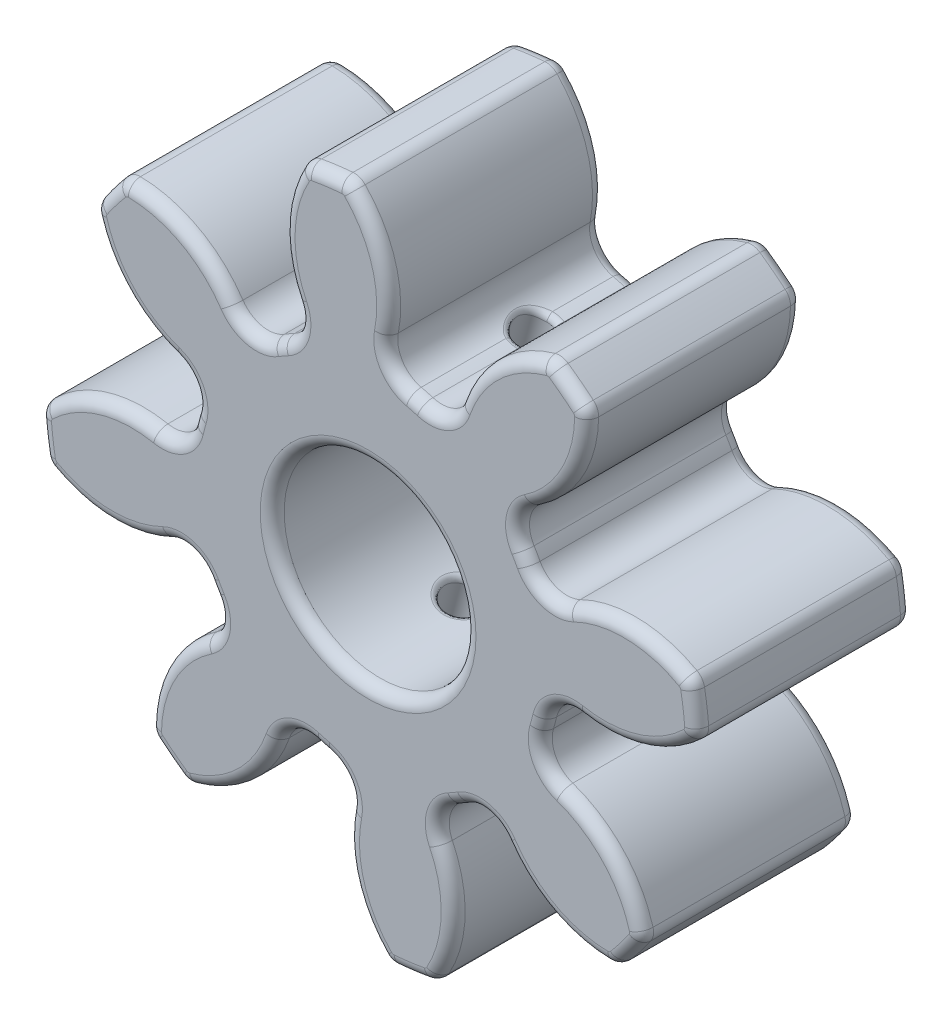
from build123d import *

# Parameters (mm, degrees)
EXTRUDE_1_DEPTH          = 4.5
PATTERN_CIRCULAR_1_COUNT = 8
SKETCH_6_R               = 7.5625
SKETCH_6_R_2             = 4
EXTRUDE_2_DEPTH          = 4.5
EXTRUDE_3_DEPTH          = 4.5
PATTERN_CIRCULAR_2_COUNT = 8
CUT_EXTRUDE_1_DEPTH      = 4.5
PATTERN_CIRCULAR_3_COUNT = 8
FILLET_1_R               = 0.5
SKETCH_9_R               = 0.75
CUT_EXTRUDE_2_DEPTH      = 10
FILLET_2_R               = 0.25


with BuildPart() as part:
    # Sketch 4 → Extrude 1 (new, symmetric)
    with BuildSketch(Plane.XY):
        with BuildLine():
            ThreePointArc((-0.83713526, 13.724492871), (-1.785764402, 13.633544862), (-2.725815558, 13.47710761))
            ThreePointArc((-2.725815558, 13.47710761), (-3.533626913, 10.269610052), (-2.260782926, 7.216665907))
            ThreePointArc((-2.260782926, 7.216665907), (-0.982170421, 7.498449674), (0.325881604, 7.555475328))
            ThreePointArc((0.325881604, 7.555475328), (0.769508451, 10.833248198), (-0.83713526, 13.724492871))
        make_face()
    extrude(amount=EXTRUDE_1_DEPTH, both=True)


with BuildPart() as pattern_circular_1_1:
    # Pattern Circular 1: pattern copy
    add(part.part.rotate(Axis((0, 0, 0), (0, 0, 1)), 1 * 360 / PATTERN_CIRCULAR_1_COUNT))


with BuildPart() as pattern_circular_1_2:
    # Pattern Circular 1: pattern copy
    add(part.part.rotate(Axis((0, 0, 0), (0, 0, 1)), 2 * 360 / PATTERN_CIRCULAR_1_COUNT))


with BuildPart() as pattern_circular_1_3:
    # Pattern Circular 1: pattern copy
    add(part.part.rotate(Axis((0, 0, 0), (0, 0, 1)), 3 * 360 / PATTERN_CIRCULAR_1_COUNT))


with BuildPart() as pattern_circular_1_4:
    # Pattern Circular 1: pattern copy
    add(part.part.rotate(Axis((0, 0, 0), (0, 0, 1)), 4 * 360 / PATTERN_CIRCULAR_1_COUNT))


with BuildPart() as pattern_circular_1_5:
    # Pattern Circular 1: pattern copy
    add(part.part.rotate(Axis((0, 0, 0), (0, 0, 1)), 5 * 360 / PATTERN_CIRCULAR_1_COUNT))


with BuildPart() as pattern_circular_1_6:
    # Pattern Circular 1: pattern copy
    add(part.part.rotate(Axis((0, 0, 0), (0, 0, 1)), 6 * 360 / PATTERN_CIRCULAR_1_COUNT))


with BuildPart() as pattern_circular_1_7:
    # Pattern Circular 1: pattern copy
    add(part.part.rotate(Axis((0, 0, 0), (0, 0, 1)), 7 * 360 / PATTERN_CIRCULAR_1_COUNT))


with BuildPart() as part_1:
    add(part.part)

    add(pattern_circular_1_1.part)  # Extrude 2 merges Pattern Circular 1_1

    add(pattern_circular_1_2.part)  # Extrude 2 merges Pattern Circular 1_2

    add(pattern_circular_1_3.part)  # Extrude 2 merges Pattern Circular 1_3

    add(pattern_circular_1_4.part)  # Extrude 2 merges Pattern Circular 1_4

    add(pattern_circular_1_5.part)  # Extrude 2 merges Pattern Circular 1_5

    add(pattern_circular_1_6.part)  # Extrude 2 merges Pattern Circular 1_6

    add(pattern_circular_1_7.part)  # Extrude 2 merges Pattern Circular 1_7
    # Sketch 6 → Extrude 2 (add, symmetric)
    with BuildSketch(Plane.XY):
        Circle(SKETCH_6_R)
        Circle(SKETCH_6_R_2, mode=Mode.SUBTRACT)
    extrude(amount=EXTRUDE_2_DEPTH, both=True)

    # Sketch 7 → Extrude 3 (add, symmetric)
    with BuildSketch(Plane.XY):
        with BuildLine():
            ThreePointArc((-2.260782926, 7.216665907), (-2.92171134, 6.975314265), (-3.557347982, 6.673580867))
            ThreePointArc((-3.557347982, 6.673580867), (-2.946423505, 7.403336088), (-3.014068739, 8.352649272))
            ThreePointArc((-3.014068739, 8.352649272), (-2.674493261, 7.76007768), (-2.260782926, 7.216665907))
        make_face()
        with BuildLine():
            ThreePointArc((-5.112094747, 5.572960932), (-5.375018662, 6.203297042), (-5.717635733, 6.794115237))
            ThreePointArc((-5.717635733, 6.794115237), (-4.930031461, 6.259839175), (-3.992367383, 6.422803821))
            ThreePointArc((-3.992367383, 6.422803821), (-4.572019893, 6.02395554), (-5.112094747, 5.572960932))
        make_face()
    extrude_3 = extrude(amount=EXTRUDE_3_DEPTH, both=True)

    # Pattern Circular 2: Extrude 3 ×8 about axis
    pattern_circular_2_axis = Axis((0, 0, 0), (0, 0, 1))
    for i in range(1, PATTERN_CIRCULAR_2_COUNT):
        add(extrude_3.rotate(pattern_circular_2_axis, i * 360 / PATTERN_CIRCULAR_2_COUNT))

    # Sketch 8 → Cut-Extrude 1 (cut, symmetric)
    with BuildSketch(Plane.XY):
        with BuildLine():
            ThreePointArc((-0.83713526, 13.724492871), (-0.982407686, 13.714859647), (-1.127569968, 13.703688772))
            ThreePointArc((-1.127569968, 13.703688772), (-0.852252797, 13.665291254), (-0.619718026, 13.512970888))
            ThreePointArc((-0.619718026, 13.512970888), (-0.726896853, 13.620304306), (-0.83713526, 13.724492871))
        make_face()
        with BuildLine():
            ThreePointArc((-2.725815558, 13.47710761), (-2.805501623, 13.348042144), (-2.881421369, 13.216725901))
            ThreePointArc((-2.881421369, 13.216725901), (-2.695960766, 13.42379661), (-2.439820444, 13.531806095))
            ThreePointArc((-2.439820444, 13.531806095), (-2.582962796, 13.505213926), (-2.725815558, 13.47710761))
        make_face()
    cut_extrude_1 = extrude(amount=CUT_EXTRUDE_1_DEPTH, both=True, mode=Mode.SUBTRACT)

    # Pattern Circular 3: Cut-Extrude 1 ×8 about axis
    pattern_circular_3_axis = Axis((0, 0, 0), (0, 0, 1))
    for i in range(1, PATTERN_CIRCULAR_3_COUNT):
        add(cut_extrude_1.rotate(pattern_circular_3_axis, i * 360 / PATTERN_CIRCULAR_3_COUNT), mode=Mode.SUBTRACT)

    # Fillet 1
    fillet_1_edges = [part_1.edges().sort_by_distance(p)[0] for p in [
        (-3.776939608, 6.551803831, -4.5),
        (-3.776939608, 6.551803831, 4.5),
        (-2.946423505, 7.403336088, -4.5),
        (-2.946423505, 7.403336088, 4.5),
        (-7.56974652, 8.481471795, -4.5),
        (-7.56974652, 8.481471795, 4.5),
        (-4.930031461, 6.259839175, -4.5),
        (-4.930031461, 6.259839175, 4.5),
        (1.962125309, 7.303524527, -4.5),
        (1.962125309, 7.303524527, 4.5),
        (3.15151311, 7.318385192, -4.5),
        (3.15151311, 7.318385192, 4.5),
        (0.644687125, 11.349925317, -4.5),
        (0.644687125, 11.349925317, 4.5),
        (0.940316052, 7.912433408, -4.5),
        (0.940316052, 7.912433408, 4.5),
        (6.551803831, 3.776939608, -4.5),
        (6.551803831, 3.776939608, 4.5),
        (7.403336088, 2.946423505, -4.5),
        (7.403336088, 2.946423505, 4.5),
        (-4, 0, -4.5),
        (8.481471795, 7.56974652, -4.5),
        (8.481471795, 7.56974652, 4.5),
        (-4, 0, 4.5),
        (6.259839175, 4.930031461, -4.5),
        (6.259839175, 4.930031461, 4.5),
        (7.303524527, -1.962125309, -4.5),
        (7.303524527, -1.962125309, 4.5),
        (7.318385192, -3.15151311, -4.5),
        (7.318385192, -3.15151311, 4.5),
        (11.349925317, -0.644687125, -4.5),
        (11.349925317, -0.644687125, 4.5),
        (7.912433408, -0.940316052, -4.5),
        (7.912433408, -0.940316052, 4.5),
        (3.776939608, -6.551803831, -4.5),
        (3.776939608, -6.551803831, 4.5),
        (2.946423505, -7.403336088, -4.5),
        (2.946423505, -7.403336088, 4.5),
        (7.56974652, -8.481471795, -4.5),
        (7.56974652, -8.481471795, 4.5),
        (4.930031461, -6.259839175, -4.5),
        (4.930031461, -6.259839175, 4.5),
        (-1.962125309, -7.303524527, -4.5),
        (-1.962125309, -7.303524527, 4.5),
        (-3.15151311, -7.318385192, -4.5),
        (-3.15151311, -7.318385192, 4.5),
        (-0.644687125, -11.349925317, -4.5),
        (-0.644687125, -11.349925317, 4.5),
        (-0.940316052, -7.912433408, -4.5),
        (-0.940316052, -7.912433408, 4.5),
        (-6.551803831, -3.776939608, -4.5),
        (-6.551803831, -3.776939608, 4.5),
        (-7.403336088, -2.946423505, -4.5),
        (-7.403336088, -2.946423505, 4.5),
        (-8.481471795, -7.56974652, -4.5),
        (-8.481471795, -7.56974652, 4.5),
        (-6.259839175, -4.930031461, -4.5),
        (-6.259839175, -4.930031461, 4.5),
        (-7.303524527, 1.962125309, -4.5),
        (-7.303524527, 1.962125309, 4.5),
        (-7.318385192, 3.15151311, -4.5),
        (-7.318385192, 3.15151311, 4.5),
        (-11.349925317, 0.644687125, -4.5),
        (-11.349925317, 0.644687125, 4.5),
        (-7.912433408, 0.940316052, -4.5),
        (-7.912433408, 0.940316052, 4.5),
        (-1.785764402, 13.633544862, -4.5),
        (-1.785764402, 13.633544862, 4.5),
        (-0.852252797, 13.665291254, -4.5),
        (-0.852252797, 13.665291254, 4.5),
        (-3.546085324, 10.801004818, -4.5),
        (-3.546085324, 10.801004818, 4.5),
        (-2.695960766, 13.42379661, -4.5),
        (-2.695960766, 13.42379661, 4.5),
        (8.377645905, 10.903098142, -4.5),
        (8.377645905, 10.903098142, 4.5),
        (9.06018638, 10.265453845, -4.5),
        (9.06018638, 10.265453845, 4.5),
        (5.130002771, 10.14492473, -4.5),
        (5.130002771, 10.14492473, 4.5),
        (7.585725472, 11.398389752, -4.5),
        (7.585725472, 11.398389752, 4.5),
        (13.633544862, 1.785764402, -4.5),
        (13.633544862, 1.785764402, 4.5),
        (13.665291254, 0.852252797, -4.5),
        (13.665291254, 0.852252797, 4.5),
        (10.801004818, 3.546085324, -4.5),
        (10.801004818, 3.546085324, 4.5),
        (13.42379661, 2.695960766, -4.5),
        (13.42379661, 2.695960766, 4.5),
        (10.903098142, -8.377645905, -4.5),
        (10.903098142, -8.377645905, 4.5),
        (10.265453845, -9.06018638, -4.5),
        (10.265453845, -9.06018638, 4.5),
        (10.14492473, -5.130002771, -4.5),
        (10.14492473, -5.130002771, 4.5),
        (11.398389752, -7.585725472, -4.5),
        (11.398389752, -7.585725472, 4.5),
        (1.785764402, -13.633544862, -4.5),
        (1.785764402, -13.633544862, 4.5),
        (0.852252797, -13.665291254, -4.5),
        (0.852252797, -13.665291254, 4.5),
        (3.546085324, -10.801004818, -4.5),
        (3.546085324, -10.801004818, 4.5),
        (2.695960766, -13.42379661, -4.5),
        (2.695960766, -13.42379661, 4.5),
        (-8.377645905, -10.903098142, -4.5),
        (-8.377645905, -10.903098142, 4.5),
        (-9.06018638, -10.265453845, -4.5),
        (-9.06018638, -10.265453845, 4.5),
        (-5.130002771, -10.14492473, -4.5),
        (-5.130002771, -10.14492473, 4.5),
        (-7.585725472, -11.398389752, -4.5),
        (-7.585725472, -11.398389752, 4.5),
        (-13.633544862, -1.785764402, -4.5),
        (-13.633544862, -1.785764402, 4.5),
        (-13.665291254, -0.852252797, -4.5),
        (-13.665291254, -0.852252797, 4.5),
        (-10.801004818, -3.546085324, -4.5),
        (-10.801004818, -3.546085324, 4.5),
        (-13.42379661, -2.695960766, -4.5),
        (-13.42379661, -2.695960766, 4.5),
        (-10.903098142, 8.377645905, -4.5),
        (-10.903098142, 8.377645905, 4.5),
        (-10.265453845, 9.06018638, -4.5),
        (-10.265453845, 9.06018638, 4.5),
        (-10.14492473, 5.130002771, -4.5),
        (-10.14492473, 5.130002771, 4.5),
        (-11.398389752, 7.585725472, -4.5),
        (-11.398389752, 7.585725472, 4.5),
    ]]
    fillet(fillet_1_edges, radius=FILLET_1_R)

    # Sketch 9 → Cut-Extrude 2 (cut, symmetric)
    with BuildSketch(Plane(origin=(0, 0, 0), x_dir=(0.9657553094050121, -0.2594545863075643, 0), z_dir=(-0.2594545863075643, -0.9657553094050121, 0))):
        with Locations((0, -0.5)):
            Circle(SKETCH_9_R)
    extrude(amount=CUT_EXTRUDE_2_DEPTH, both=True, mode=Mode.SUBTRACT)

    # Fillet 2
    fillet_2_edges = [part_1.edges().sort_by_distance(p)[0] for p in [
        (-1.37969838, -7.497254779, -0.932483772),
        (-1.743728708, -3.599918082, -0.499999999),
        (0.295095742, 3.989099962, -0.499999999),
        (1.962125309, 7.303524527, -1.250000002),
        (2.563223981, 7.179295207, -0.067516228),
        (1.962125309, 7.303524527, 0.250000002),
        (1.258595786, 7.575489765, -0.5),
        (-1.962125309, -7.303524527, -1.250000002),
        (-2.70722875, -7.186307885, -0.5),
        (-1.962125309, -7.303524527, 0.250000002),
    ]]
    fillet(fillet_2_edges, radius=FILLET_2_R)


solid = part_1.part
